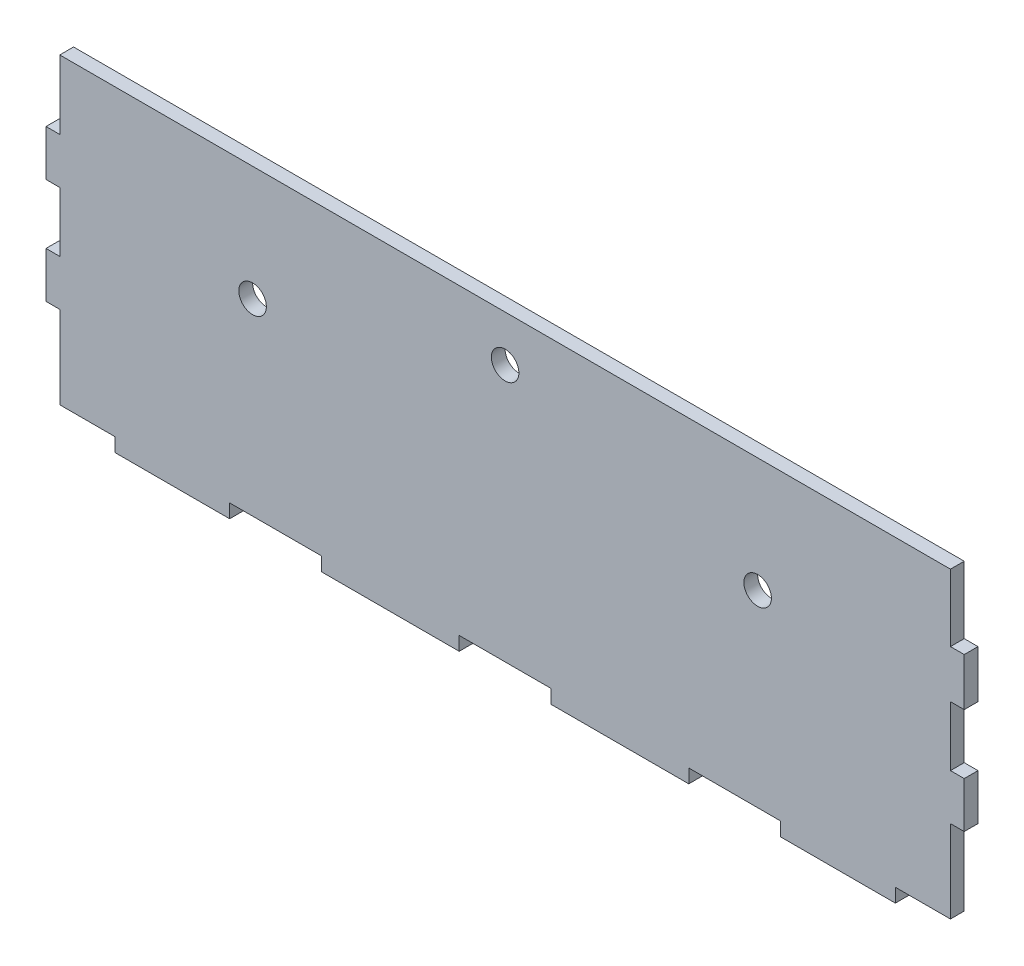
from build123d import *

# Parameters (mm, degrees)
CROQUIS1_W              = 200
CROQUIS1_H              = 75
SALIENTE_EXTRUIR1_DEPTH = 3
CROQUIS2_R              = 3
CROQUIS2_W              = 20
CROQUIS2_H              = 3
CROQUIS2_W_2            = 3
CROQUIS2_H_2            = 13
CORTAR_EXTRUIR1_DEPTH   = 6


with BuildPart() as part:
    # Croquis1 → Saliente-Extruir1 (new body)
    with BuildSketch(Plane.XY):
        with Locations((100, 37.5)):
            Rectangle(CROQUIS1_W, CROQUIS1_H)
    extrude(amount=SALIENTE_EXTRUIR1_DEPTH)

    # Croquis2 → Cortar-Extruir1 (cut)
    with BuildSketch(Plane.XY.offset(3)):
        with Locations((100, 59)):
            Circle(CROQUIS2_R)
        with Locations((155, 44)):
            Circle(CROQUIS2_R)
        with Locations(Location((45, 44, 0), (0, 0, 180))):
            Circle(CROQUIS2_R)
        Polygon((0, 75), (15, 75), (40, 75), (60, 75), (90, 75), (110, 75), (140, 75), (160, 75), (185, 75), (200, 75), (200, 54.392981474), (197, 54.392981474), (197, 66), (197, 69), (3, 69), (3, 66), (3, 54), (0, 54), align=None)
        Polygon((3, 3), (3, 21), (0, 21), (0, 0), (15, 0), (15, 3), align=None)
        Polygon((185, 3), (197, 3), (197, 21), (200, 21), (200, 0), (185, 0), align=None)
        with Locations((150, 1.5)):
            Rectangle(CROQUIS2_W, CROQUIS2_H)
        with Locations((100, 1.5)):
            Rectangle(CROQUIS2_W, CROQUIS2_H)
        with Locations((50, 1.5)):
            Rectangle(CROQUIS2_W, CROQUIS2_H)
        with Locations((1.5, 37.5)):
            Rectangle(CROQUIS2_W_2, CROQUIS2_H_2)
        with Locations((198.5, 37.5)):
            Rectangle(CROQUIS2_W_2, CROQUIS2_H_2)
    extrude(amount=-CORTAR_EXTRUIR1_DEPTH, mode=Mode.SUBTRACT)


solid = part.part
